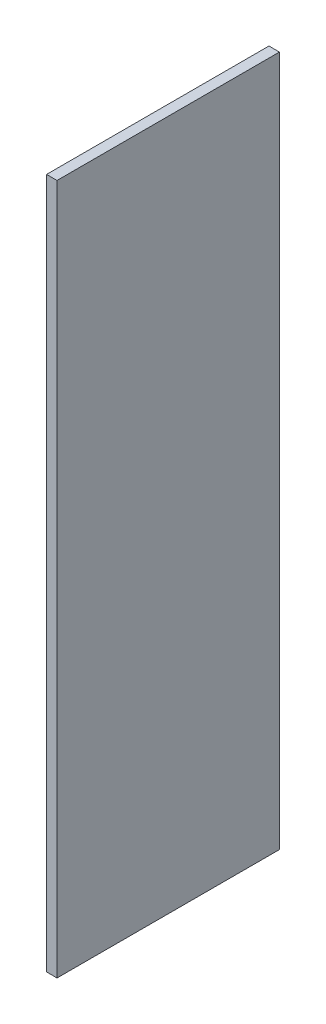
from build123d import *

# Parameters (mm, degrees)
SKETCH1_W           = 134.9375
SKETCH1_H           = 419.1
BOSS_EXTRUDE1_DEPTH = 6.35


with BuildPart() as part:
    # Sketch1 → Boss-Extrude1 (new body)
    with BuildSketch(Plane(origin=(0, 0, 0), x_dir=(0, 0, -1), z_dir=(1, 0, 0))):
        with Locations((-3.890112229, -50.927786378)):
            Rectangle(SKETCH1_W, SKETCH1_H)
    extrude(amount=BOSS_EXTRUDE1_DEPTH)


solid = part.part
